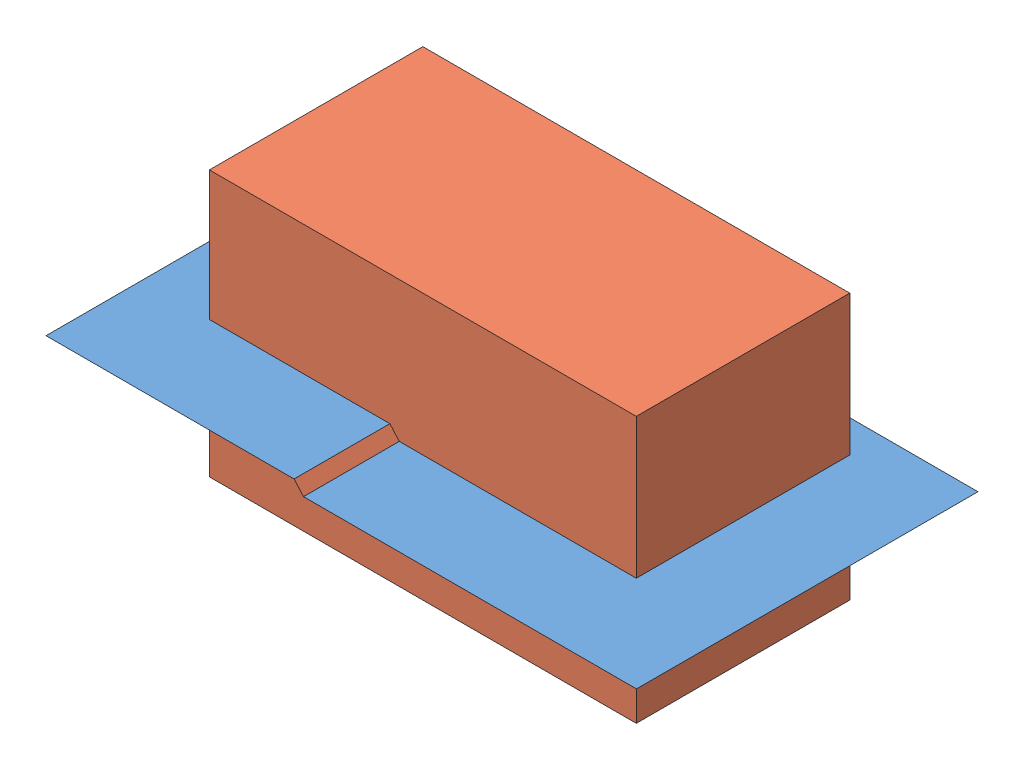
SolidWorks assembly Formtrennung.SLDASM, configuration Standard (file format 3100). Lengths in mm.
Overall size (345.8 155.7 200).
2 component instances, 2 part files, 0 mates.
Components (placement in the parent):
- Help2-1: Help2.SLDPRT [Standard] at origin size (345.8 15 200)
- Formkasten-1: Formkasten.SLDPRT [Standard] at origin size (345.8 155.7 200)
